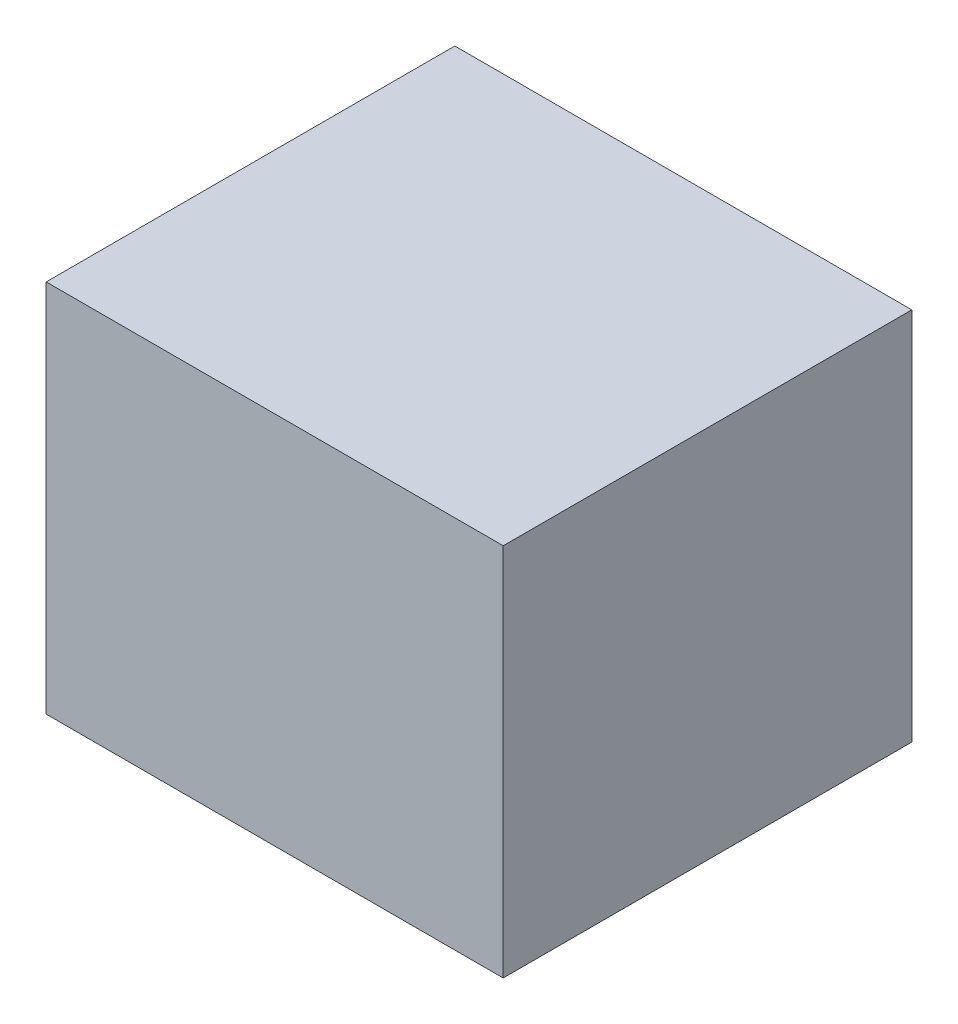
ISO-10303-21;
HEADER;
FILE_DESCRIPTION(('STEP AP214'),'2;1');
FILE_NAME('part.step','',(''),(''),'','','');
FILE_SCHEMA(('AUTOMOTIVE_DESIGN { 1 0 10303 214 1 1 1 1 }'));
ENDSEC;
DATA;
#1=APPLICATION_CONTEXT('core data for automotive mechanical design processes');
#2=APPLICATION_PROTOCOL_DEFINITION('international standard','automotive_design',2000,#1);
#3=PRODUCT_CONTEXT('',#1,'mechanical');
#4=PRODUCT('Part','Part','',(#3));
#5=PRODUCT_RELATED_PRODUCT_CATEGORY('part','',(#4));
#6=PRODUCT_DEFINITION_FORMATION('','',#4);
#7=PRODUCT_DEFINITION_CONTEXT('part definition',#1,'design');
#8=PRODUCT_DEFINITION('design','',#6,#7);
#9=PRODUCT_DEFINITION_SHAPE('','',#8);
#10=(LENGTH_UNIT() NAMED_UNIT(*) SI_UNIT(.MILLI.,.METRE.));
#11=(NAMED_UNIT(*) PLANE_ANGLE_UNIT() SI_UNIT($,.RADIAN.));
#12=(NAMED_UNIT(*) SI_UNIT($,.STERADIAN.) SOLID_ANGLE_UNIT());
#13=UNCERTAINTY_MEASURE_WITH_UNIT(LENGTH_MEASURE(1.E-05),#10,'distance_accuracy_value','');
#14=(GEOMETRIC_REPRESENTATION_CONTEXT(3) GLOBAL_UNCERTAINTY_ASSIGNED_CONTEXT((#13)) GLOBAL_UNIT_ASSIGNED_CONTEXT((#10,
#11,#12)) REPRESENTATION_CONTEXT('',''));
#15=CARTESIAN_POINT('',(0.,0.,0.));
#16=DIRECTION('',(0.,0.,1.));
#17=DIRECTION('',(1.,0.,0.));
#18=AXIS2_PLACEMENT_3D('',#15,#16,#17);
#19=CARTESIAN_POINT('',(0.,0.,46.));
#20=DIRECTION('',(1.,0.,0.));
#21=DIRECTION('',(0.,0.,-1.));
#22=AXIS2_PLACEMENT_3D('',#19,#20,#21);
#23=PLANE('',#22);
#24=DIRECTION('',(0.,-1.,0.));
#25=VECTOR('',#24,1.);
#26=CARTESIAN_POINT('',(0.,0.,0.));
#27=LINE('',#26,#25);
#28=CARTESIAN_POINT('',(0.,42.1439181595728,0.));
#29=VERTEX_POINT('',#28);
#30=CARTESIAN_POINT('',(0.,0.,0.));
#31=VERTEX_POINT('',#30);
#32=EDGE_CURVE('E94',#29,#31,#27,.T.);
#33=ORIENTED_EDGE('',*,*,#32,.T.);
#34=DIRECTION('',(0.,0.,-1.));
#35=VECTOR('',#34,1.);
#36=CARTESIAN_POINT('',(0.,0.,46.));
#37=LINE('',#36,#35);
#38=CARTESIAN_POINT('',(0.,0.,46.));
#39=VERTEX_POINT('',#38);
#40=EDGE_CURVE('E11',#39,#31,#37,.T.);
#41=ORIENTED_EDGE('',*,*,#40,.F.);
#42=DIRECTION('',(0.,-1.,0.));
#43=VECTOR('',#42,1.);
#44=CARTESIAN_POINT('',(0.,0.,46.));
#45=LINE('',#44,#43);
#46=CARTESIAN_POINT('',(0.,42.1439181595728,46.));
#47=VERTEX_POINT('',#46);
#48=EDGE_CURVE('E82',#47,#39,#45,.T.);
#49=ORIENTED_EDGE('',*,*,#48,.F.);
#50=DIRECTION('',(0.,0.,-1.));
#51=VECTOR('',#50,1.);
#52=CARTESIAN_POINT('',(0.,42.1439181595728,46.));
#53=LINE('',#52,#51);
#54=EDGE_CURVE('E90',#47,#29,#53,.T.);
#55=ORIENTED_EDGE('',*,*,#54,.T.);
#56=EDGE_LOOP('',(#33,#41,#49,#55));
#57=FACE_BOUND('',#56,.T.);
#58=ADVANCED_FACE('F31',(#57),#23,.F.);
#59=CARTESIAN_POINT('',(0.,0.,46.));
#60=DIRECTION('',(0.,1.,0.));
#61=DIRECTION('',(0.,0.,1.));
#62=AXIS2_PLACEMENT_3D('',#59,#60,#61);
#63=PLANE('',#62);
#64=DIRECTION('',(1.,0.,0.));
#65=VECTOR('',#64,1.);
#66=CARTESIAN_POINT('',(0.,0.,0.));
#67=LINE('',#66,#65);
#68=CARTESIAN_POINT('',(51.4493248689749,0.,0.));
#69=VERTEX_POINT('',#68);
#70=EDGE_CURVE('E86',#31,#69,#67,.T.);
#71=ORIENTED_EDGE('',*,*,#70,.T.);
#72=DIRECTION('',(0.,0.,-1.));
#73=VECTOR('',#72,1.);
#74=CARTESIAN_POINT('',(51.4493248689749,0.,46.));
#75=LINE('',#74,#73);
#76=CARTESIAN_POINT('',(51.4493248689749,0.,46.));
#77=VERTEX_POINT('',#76);
#78=EDGE_CURVE('E39',#77,#69,#75,.T.);
#79=ORIENTED_EDGE('',*,*,#78,.F.);
#80=DIRECTION('',(1.,0.,0.));
#81=VECTOR('',#80,1.);
#82=CARTESIAN_POINT('',(0.,0.,46.));
#83=LINE('',#82,#81);
#84=EDGE_CURVE('E77',#39,#77,#83,.T.);
#85=ORIENTED_EDGE('',*,*,#84,.F.);
#86=ORIENTED_EDGE('',*,*,#40,.T.);
#87=EDGE_LOOP('',(#71,#79,#85,#86));
#88=FACE_BOUND('',#87,.T.);
#89=ADVANCED_FACE('F85',(#88),#63,.F.);
#90=CARTESIAN_POINT('',(51.4493248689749,0.,46.));
#91=DIRECTION('',(-1.,0.,0.));
#92=DIRECTION('',(0.,0.,1.));
#93=AXIS2_PLACEMENT_3D('',#90,#91,#92);
#94=PLANE('',#93);
#95=DIRECTION('',(0.,1.,0.));
#96=VECTOR('',#95,1.);
#97=CARTESIAN_POINT('',(51.4493248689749,0.,0.));
#98=LINE('',#97,#96);
#99=CARTESIAN_POINT('',(51.4493248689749,42.1439181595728,0.));
#100=VERTEX_POINT('',#99);
#101=EDGE_CURVE('E64',#69,#100,#98,.T.);
#102=ORIENTED_EDGE('',*,*,#101,.T.);
#103=DIRECTION('',(0.,0.,-1.));
#104=VECTOR('',#103,1.);
#105=CARTESIAN_POINT('',(51.4493248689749,42.1439181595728,46.));
#106=LINE('',#105,#104);
#107=CARTESIAN_POINT('',(51.4493248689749,42.1439181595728,46.));
#108=VERTEX_POINT('',#107);
#109=EDGE_CURVE('E87',#108,#100,#106,.T.);
#110=ORIENTED_EDGE('',*,*,#109,.F.);
#111=DIRECTION('',(0.,1.,0.));
#112=VECTOR('',#111,1.);
#113=CARTESIAN_POINT('',(51.4493248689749,0.,46.));
#114=LINE('',#113,#112);
#115=EDGE_CURVE('E80',#77,#108,#114,.T.);
#116=ORIENTED_EDGE('',*,*,#115,.F.);
#117=ORIENTED_EDGE('',*,*,#78,.T.);
#118=EDGE_LOOP('',(#102,#110,#116,#117));
#119=FACE_BOUND('',#118,.T.);
#120=ADVANCED_FACE('F88',(#119),#94,.F.);
#121=CARTESIAN_POINT('',(0.,42.1439181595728,46.));
#122=DIRECTION('',(0.,-1.,0.));
#123=DIRECTION('',(0.,0.,-1.));
#124=AXIS2_PLACEMENT_3D('',#121,#122,#123);
#125=PLANE('',#124);
#126=DIRECTION('',(-1.,0.,0.));
#127=VECTOR('',#126,1.);
#128=CARTESIAN_POINT('',(0.,42.1439181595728,0.));
#129=LINE('',#128,#127);
#130=EDGE_CURVE('E70',#100,#29,#129,.T.);
#131=ORIENTED_EDGE('',*,*,#130,.T.);
#132=ORIENTED_EDGE('',*,*,#54,.F.);
#133=DIRECTION('',(-1.,0.,0.));
#134=VECTOR('',#133,1.);
#135=CARTESIAN_POINT('',(0.,42.1439181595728,46.));
#136=LINE('',#135,#134);
#137=EDGE_CURVE('E47',#108,#47,#136,.T.);
#138=ORIENTED_EDGE('',*,*,#137,.F.);
#139=ORIENTED_EDGE('',*,*,#109,.T.);
#140=EDGE_LOOP('',(#131,#132,#138,#139));
#141=FACE_BOUND('',#140,.T.);
#142=ADVANCED_FACE('F101',(#141),#125,.F.);
#143=CARTESIAN_POINT('',(0.,42.1439181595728,46.));
#144=DIRECTION('',(0.,0.,-1.));
#145=DIRECTION('',(-1.,0.,0.));
#146=AXIS2_PLACEMENT_3D('',#143,#144,#145);
#147=PLANE('',#146);
#148=ORIENTED_EDGE('',*,*,#48,.T.);
#149=ORIENTED_EDGE('',*,*,#84,.T.);
#150=ORIENTED_EDGE('',*,*,#115,.T.);
#151=ORIENTED_EDGE('',*,*,#137,.T.);
#152=EDGE_LOOP('',(#148,#149,#150,#151));
#153=FACE_BOUND('',#152,.T.);
#154=ADVANCED_FACE('F78',(#153),#147,.F.);
#155=CARTESIAN_POINT('',(0.,42.1439181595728,0.));
#156=DIRECTION('',(0.,0.,-1.));
#157=DIRECTION('',(-1.,0.,0.));
#158=AXIS2_PLACEMENT_3D('',#155,#156,#157);
#159=PLANE('',#158);
#160=ORIENTED_EDGE('',*,*,#32,.F.);
#161=ORIENTED_EDGE('',*,*,#130,.F.);
#162=ORIENTED_EDGE('',*,*,#101,.F.);
#163=ORIENTED_EDGE('',*,*,#70,.F.);
#164=EDGE_LOOP('',(#160,#161,#162,#163));
#165=FACE_BOUND('',#164,.T.);
#166=ADVANCED_FACE('F104',(#165),#159,.T.);
#167=CLOSED_SHELL('',(#58,#89,#120,#142,#154,#166));
#168=MANIFOLD_SOLID_BREP('B2',#167);
#169=ADVANCED_BREP_SHAPE_REPRESENTATION('',(#18,#168),#14);
#170=SHAPE_DEFINITION_REPRESENTATION(#9,#169);
ENDSEC;
END-ISO-10303-21;
